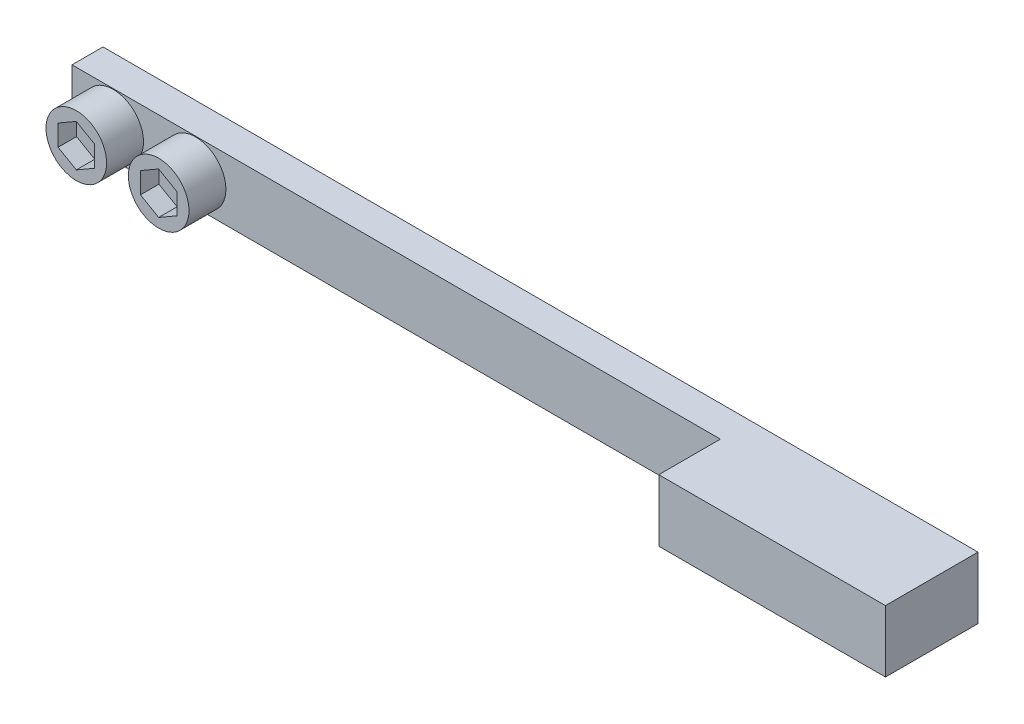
from build123d import *

# Parameters (mm, degrees)
EXTRUDE1_DEPTH     = 4.7752
SKETCH2_R          = 2.3368
EXTRUDE2_DEPTH     = 2.8448
CUT_EXTRUDE1_DEPTH = 1.4224
SKETCH4_R          = 2.3368
EXTRUDE3_DEPTH     = 2.8448
CUT_EXTRUDE2_DEPTH = 1.4224


with BuildPart() as part:
    # Sketch1 → Extrude1 (new body)
    with BuildSketch(Plane(origin=(0, -2.3876, 0), x_dir=(-1, 0, 0), z_dir=(0, 1, 0))):
        Polygon((33.7312, -1.1938), (33.7312, 1.1938), (-16.256, 1.1938), (-16.256, 5.9436), (-33.7312, 5.9436), (-33.7312, -1.1938), align=None)
    extrude(amount=EXTRUDE1_DEPTH)

    # Sketch2 → Extrude2 (add)
    with BuildSketch(Plane.XY.offset(1.1938)):
        with Locations(Location((-30.5562, 0, 0), (0, 0, 180))):
            Circle(SKETCH2_R)
    extrude(amount=EXTRUDE2_DEPTH)

    # Sketch3 → Cut-Extrude1 (cut)
    with BuildSketch(Plane.XY.offset(4.0386)):
        Polygon((-31.95828, 0.809491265), (-31.95828, -0.809491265), (-30.5562, -1.618982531), (-29.15412, -0.809491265), (-29.15412, 0.809491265), (-30.5562, 1.618982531), align=None)
    extrude(amount=-CUT_EXTRUDE1_DEPTH, mode=Mode.SUBTRACT)

    # Sketch4 → Extrude3 (add)
    with BuildSketch(Plane.XY.offset(1.1938)):
        with Locations(Location((-24.2062, 0, 0), (0, 0, 180))):
            Circle(SKETCH4_R)
    extrude(amount=EXTRUDE3_DEPTH)

    # Sketch5 → Cut-Extrude2 (cut)
    with BuildSketch(Plane.XY.offset(4.0386)):
        Polygon((-25.60828, 0.809491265), (-25.60828, -0.809491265), (-24.2062, -1.618982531), (-22.80412, -0.809491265), (-22.80412, 0.809491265), (-24.2062, 1.618982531), align=None)
    extrude(amount=-CUT_EXTRUDE2_DEPTH, mode=Mode.SUBTRACT)


solid = part.part
